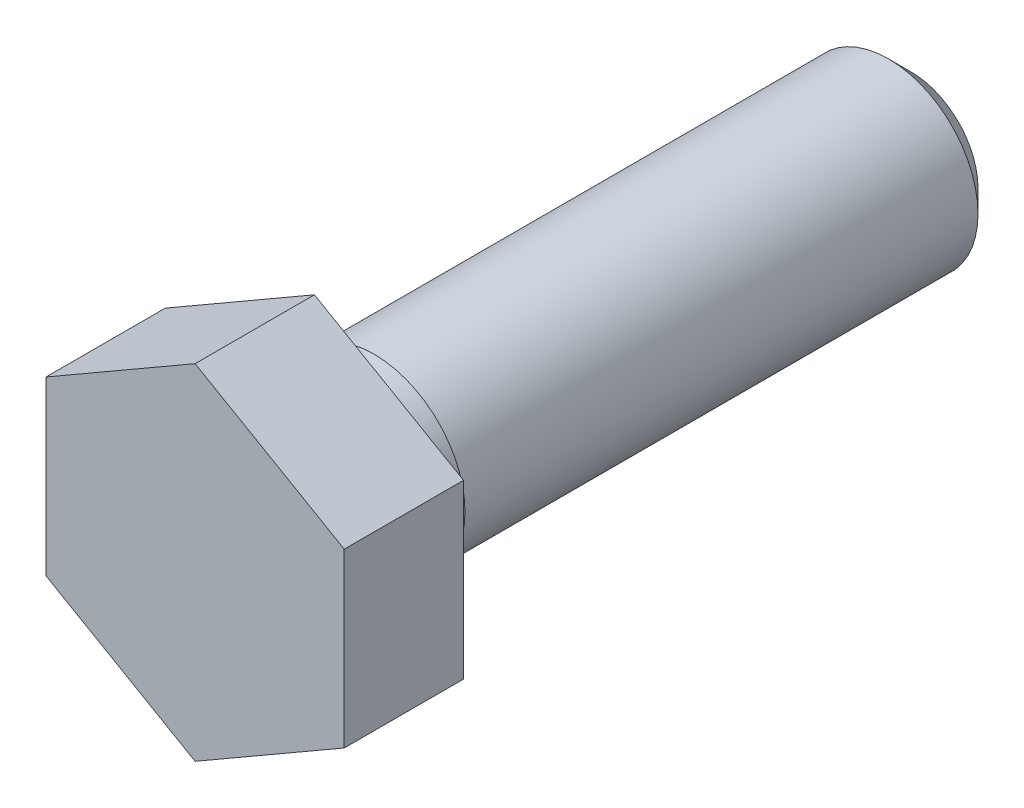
ISO-10303-21;
HEADER;
FILE_DESCRIPTION(('STEP AP214'),'2;1');
FILE_NAME('part.step','',(''),(''),'','','');
FILE_SCHEMA(('AUTOMOTIVE_DESIGN { 1 0 10303 214 1 1 1 1 }'));
ENDSEC;
DATA;
#1=APPLICATION_CONTEXT('core data for automotive mechanical design processes');
#2=APPLICATION_PROTOCOL_DEFINITION('international standard','automotive_design',2000,#1);
#3=PRODUCT_CONTEXT('',#1,'mechanical');
#4=PRODUCT('Part','Part','',(#3));
#5=PRODUCT_RELATED_PRODUCT_CATEGORY('part','',(#4));
#6=PRODUCT_DEFINITION_FORMATION('','',#4);
#7=PRODUCT_DEFINITION_CONTEXT('part definition',#1,'design');
#8=PRODUCT_DEFINITION('design','',#6,#7);
#9=PRODUCT_DEFINITION_SHAPE('','',#8);
#10=(LENGTH_UNIT() NAMED_UNIT(*) SI_UNIT(.MILLI.,.METRE.));
#11=(NAMED_UNIT(*) PLANE_ANGLE_UNIT() SI_UNIT($,.RADIAN.));
#12=(NAMED_UNIT(*) SI_UNIT($,.STERADIAN.) SOLID_ANGLE_UNIT());
#13=UNCERTAINTY_MEASURE_WITH_UNIT(LENGTH_MEASURE(1.E-05),#10,'distance_accuracy_value','');
#14=(GEOMETRIC_REPRESENTATION_CONTEXT(3) GLOBAL_UNCERTAINTY_ASSIGNED_CONTEXT((#13)) GLOBAL_UNIT_ASSIGNED_CONTEXT((#10,
#11,#12)) REPRESENTATION_CONTEXT('',''));
#15=CARTESIAN_POINT('',(0.,0.,0.));
#16=DIRECTION('',(0.,0.,1.));
#17=DIRECTION('',(1.,0.,0.));
#18=AXIS2_PLACEMENT_3D('',#15,#16,#17);
#19=CARTESIAN_POINT('',(0.,0.,-3.));
#20=DIRECTION('',(0.,0.,1.));
#21=DIRECTION('',(1.,0.,0.));
#22=AXIS2_PLACEMENT_3D('',#19,#20,#21);
#23=CYLINDRICAL_SURFACE('',#22,3.05);
#24=CARTESIAN_POINT('',(0.,0.,0.));
#25=DIRECTION('',(0.,0.,1.));
#26=DIRECTION('',(1.,0.,0.));
#27=AXIS2_PLACEMENT_3D('',#24,#25,#26);
#28=CIRCLE('',#27,3.05);
#29=CARTESIAN_POINT('',(3.05,0.,0.));
#30=VERTEX_POINT('',#29);
#31=EDGE_CURVE('E9',#30,#30,#28,.F.);
#32=ORIENTED_EDGE('',*,*,#31,.T.);
#33=EDGE_LOOP('',(#32));
#34=FACE_BOUND('',#33,.T.);
#35=CARTESIAN_POINT('',(0.,0.,-2.));
#36=DIRECTION('',(0.,0.,-1.));
#37=DIRECTION('',(0.,1.,0.));
#38=AXIS2_PLACEMENT_3D('',#35,#36,#37);
#39=CIRCLE('',#38,3.05);
#40=CARTESIAN_POINT('',(0.,3.05,-2.));
#41=VERTEX_POINT('',#40);
#42=EDGE_CURVE('E88',#41,#41,#39,.T.);
#43=ORIENTED_EDGE('',*,*,#42,.F.);
#44=EDGE_LOOP('',(#43));
#45=FACE_BOUND('',#44,.T.);
#46=ADVANCED_FACE('F14',(#34,#45),#23,.T.);
#47=CARTESIAN_POINT('',(0.,-5.77350269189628,0.));
#48=DIRECTION('',(0.,0.,1.));
#49=DIRECTION('',(1.,0.,0.));
#50=AXIS2_PLACEMENT_3D('',#47,#48,#49);
#51=PLANE('',#50);
#52=DIRECTION('',(-0.866025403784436,-0.5,0.));
#53=VECTOR('',#52,1.);
#54=CARTESIAN_POINT('',(5.,-2.8867513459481,0.));
#55=LINE('',#54,#53);
#56=CARTESIAN_POINT('',(5.,-2.8867513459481,0.));
#57=VERTEX_POINT('',#56);
#58=CARTESIAN_POINT('',(0.,-5.77350269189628,0.));
#59=VERTEX_POINT('',#58);
#60=EDGE_CURVE('E69',#57,#59,#55,.T.);
#61=ORIENTED_EDGE('',*,*,#60,.T.);
#62=DIRECTION('',(0.866025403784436,-0.5,0.));
#63=VECTOR('',#62,1.);
#64=CARTESIAN_POINT('',(-5.,-2.8867513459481,0.));
#65=LINE('',#64,#63);
#66=CARTESIAN_POINT('',(-5.,-2.8867513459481,0.));
#67=VERTEX_POINT('',#66);
#68=EDGE_CURVE('E84',#67,#59,#65,.T.);
#69=ORIENTED_EDGE('',*,*,#68,.F.);
#70=DIRECTION('',(0.,1.,0.));
#71=VECTOR('',#70,1.);
#72=CARTESIAN_POINT('',(-5.,-2.8867513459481,0.));
#73=LINE('',#72,#71);
#74=CARTESIAN_POINT('',(-5.,2.88675134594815,0.));
#75=VERTEX_POINT('',#74);
#76=EDGE_CURVE('E91',#67,#75,#73,.T.);
#77=ORIENTED_EDGE('',*,*,#76,.T.);
#78=DIRECTION('',(0.86602540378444,0.5,0.));
#79=VECTOR('',#78,1.);
#80=CARTESIAN_POINT('',(-5.,2.88675134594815,0.));
#81=LINE('',#80,#79);
#82=CARTESIAN_POINT('',(0.,5.77350269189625,0.));
#83=VERTEX_POINT('',#82);
#84=EDGE_CURVE('E93',#75,#83,#81,.T.);
#85=ORIENTED_EDGE('',*,*,#84,.T.);
#86=DIRECTION('',(-0.86602540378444,0.5,0.));
#87=VECTOR('',#86,1.);
#88=CARTESIAN_POINT('',(5.,2.88675134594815,0.));
#89=LINE('',#88,#87);
#90=CARTESIAN_POINT('',(5.,2.88675134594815,0.));
#91=VERTEX_POINT('',#90);
#92=EDGE_CURVE('E261',#91,#83,#89,.T.);
#93=ORIENTED_EDGE('',*,*,#92,.F.);
#94=DIRECTION('',(0.,1.,0.));
#95=VECTOR('',#94,1.);
#96=CARTESIAN_POINT('',(5.,-2.8867513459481,0.));
#97=LINE('',#96,#95);
#98=EDGE_CURVE('E87',#57,#91,#97,.T.);
#99=ORIENTED_EDGE('',*,*,#98,.F.);
#100=EDGE_LOOP('',(#61,#69,#77,#85,#93,#99));
#101=FACE_BOUND('',#100,.T.);
#102=ORIENTED_EDGE('',*,*,#31,.F.);
#103=EDGE_LOOP('',(#102));
#104=FACE_BOUND('',#103,.T.);
#105=ADVANCED_FACE('F81',(#101,#104),#51,.F.);
#106=CARTESIAN_POINT('',(5.,-2.8867513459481,4.));
#107=DIRECTION('',(0.5,-0.866025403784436,0.));
#108=DIRECTION('',(0.866025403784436,0.5,0.));
#109=AXIS2_PLACEMENT_3D('',#106,#107,#108);
#110=PLANE('',#109);
#111=DIRECTION('',(0.,0.,-1.));
#112=VECTOR('',#111,1.);
#113=CARTESIAN_POINT('',(5.,-2.8867513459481,4.));
#114=LINE('',#113,#112);
#115=CARTESIAN_POINT('',(5.,-2.8867513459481,4.));
#116=VERTEX_POINT('',#115);
#117=EDGE_CURVE('E29',#116,#57,#114,.T.);
#118=ORIENTED_EDGE('',*,*,#117,.F.);
#119=DIRECTION('',(-0.866025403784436,-0.5,0.));
#120=VECTOR('',#119,1.);
#121=CARTESIAN_POINT('',(5.,-2.8867513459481,4.));
#122=LINE('',#121,#120);
#123=CARTESIAN_POINT('',(0.,-5.77350269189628,4.));
#124=VERTEX_POINT('',#123);
#125=EDGE_CURVE('E71',#116,#124,#122,.T.);
#126=ORIENTED_EDGE('',*,*,#125,.T.);
#127=DIRECTION('',(0.,0.,-1.));
#128=VECTOR('',#127,1.);
#129=CARTESIAN_POINT('',(0.,-5.77350269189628,4.));
#130=LINE('',#129,#128);
#131=EDGE_CURVE('E66',#124,#59,#130,.T.);
#132=ORIENTED_EDGE('',*,*,#131,.T.);
#133=ORIENTED_EDGE('',*,*,#60,.F.);
#134=EDGE_LOOP('',(#118,#126,#132,#133));
#135=FACE_BOUND('',#134,.T.);
#136=ADVANCED_FACE('F68',(#135),#110,.T.);
#137=CARTESIAN_POINT('',(5.,-2.8867513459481,4.));
#138=DIRECTION('',(-1.,0.,0.));
#139=DIRECTION('',(0.,-1.,0.));
#140=AXIS2_PLACEMENT_3D('',#137,#138,#139);
#141=PLANE('',#140);
#142=DIRECTION('',(0.,0.,-1.));
#143=VECTOR('',#142,1.);
#144=CARTESIAN_POINT('',(5.,2.88675134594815,4.));
#145=LINE('',#144,#143);
#146=CARTESIAN_POINT('',(5.,2.88675134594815,4.));
#147=VERTEX_POINT('',#146);
#148=EDGE_CURVE('E37',#147,#91,#145,.T.);
#149=ORIENTED_EDGE('',*,*,#148,.F.);
#150=DIRECTION('',(0.,1.,0.));
#151=VECTOR('',#150,1.);
#152=CARTESIAN_POINT('',(5.,-2.8867513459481,4.));
#153=LINE('',#152,#151);
#154=EDGE_CURVE('E77',#116,#147,#153,.T.);
#155=ORIENTED_EDGE('',*,*,#154,.F.);
#156=ORIENTED_EDGE('',*,*,#117,.T.);
#157=ORIENTED_EDGE('',*,*,#98,.T.);
#158=EDGE_LOOP('',(#149,#155,#156,#157));
#159=FACE_BOUND('',#158,.T.);
#160=ADVANCED_FACE('F155',(#159),#141,.F.);
#161=CARTESIAN_POINT('',(5.,2.88675134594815,4.));
#162=DIRECTION('',(-0.5,-0.86602540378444,0.));
#163=DIRECTION('',(0.86602540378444,-0.5,0.));
#164=AXIS2_PLACEMENT_3D('',#161,#162,#163);
#165=PLANE('',#164);
#166=DIRECTION('',(0.,0.,-1.));
#167=VECTOR('',#166,1.);
#168=CARTESIAN_POINT('',(0.,5.77350269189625,4.));
#169=LINE('',#168,#167);
#170=CARTESIAN_POINT('',(0.,5.77350269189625,4.));
#171=VERTEX_POINT('',#170);
#172=EDGE_CURVE('E114',#171,#83,#169,.T.);
#173=ORIENTED_EDGE('',*,*,#172,.F.);
#174=DIRECTION('',(-0.86602540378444,0.5,0.));
#175=VECTOR('',#174,1.);
#176=CARTESIAN_POINT('',(5.,2.88675134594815,4.));
#177=LINE('',#176,#175);
#178=EDGE_CURVE('E99',#147,#171,#177,.T.);
#179=ORIENTED_EDGE('',*,*,#178,.F.);
#180=ORIENTED_EDGE('',*,*,#148,.T.);
#181=ORIENTED_EDGE('',*,*,#92,.T.);
#182=EDGE_LOOP('',(#173,#179,#180,#181));
#183=FACE_BOUND('',#182,.T.);
#184=ADVANCED_FACE('F164',(#183),#165,.F.);
#185=CARTESIAN_POINT('',(-5.,2.88675134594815,4.));
#186=DIRECTION('',(-0.5,0.86602540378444,0.));
#187=DIRECTION('',(-0.86602540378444,-0.5,0.));
#188=AXIS2_PLACEMENT_3D('',#185,#186,#187);
#189=PLANE('',#188);
#190=DIRECTION('',(0.,0.,-1.));
#191=VECTOR('',#190,1.);
#192=CARTESIAN_POINT('',(-5.,2.88675134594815,4.));
#193=LINE('',#192,#191);
#194=CARTESIAN_POINT('',(-5.,2.88675134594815,4.));
#195=VERTEX_POINT('',#194);
#196=EDGE_CURVE('E112',#195,#75,#193,.T.);
#197=ORIENTED_EDGE('',*,*,#196,.F.);
#198=DIRECTION('',(0.86602540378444,0.5,0.));
#199=VECTOR('',#198,1.);
#200=CARTESIAN_POINT('',(-5.,2.88675134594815,4.));
#201=LINE('',#200,#199);
#202=EDGE_CURVE('E102',#195,#171,#201,.T.);
#203=ORIENTED_EDGE('',*,*,#202,.T.);
#204=ORIENTED_EDGE('',*,*,#172,.T.);
#205=ORIENTED_EDGE('',*,*,#84,.F.);
#206=EDGE_LOOP('',(#197,#203,#204,#205));
#207=FACE_BOUND('',#206,.T.);
#208=ADVANCED_FACE('F160',(#207),#189,.T.);
#209=CARTESIAN_POINT('',(-5.,-2.8867513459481,4.));
#210=DIRECTION('',(-1.,0.,0.));
#211=DIRECTION('',(0.,0.,1.));
#212=AXIS2_PLACEMENT_3D('',#209,#210,#211);
#213=PLANE('',#212);
#214=DIRECTION('',(0.,0.,-1.));
#215=VECTOR('',#214,1.);
#216=CARTESIAN_POINT('',(-5.,-2.8867513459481,4.));
#217=LINE('',#216,#215);
#218=CARTESIAN_POINT('',(-5.,-2.8867513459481,4.));
#219=VERTEX_POINT('',#218);
#220=EDGE_CURVE('E76',#219,#67,#217,.T.);
#221=ORIENTED_EDGE('',*,*,#220,.F.);
#222=DIRECTION('',(0.,1.,0.));
#223=VECTOR('',#222,1.);
#224=CARTESIAN_POINT('',(-5.,-2.8867513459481,4.));
#225=LINE('',#224,#223);
#226=EDGE_CURVE('E105',#219,#195,#225,.T.);
#227=ORIENTED_EDGE('',*,*,#226,.T.);
#228=ORIENTED_EDGE('',*,*,#196,.T.);
#229=ORIENTED_EDGE('',*,*,#76,.F.);
#230=EDGE_LOOP('',(#221,#227,#228,#229));
#231=FACE_BOUND('',#230,.T.);
#232=ADVANCED_FACE('F152',(#231),#213,.T.);
#233=CARTESIAN_POINT('',(-5.,-2.8867513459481,4.));
#234=DIRECTION('',(0.5,0.866025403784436,0.));
#235=DIRECTION('',(-0.866025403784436,0.5,0.));
#236=AXIS2_PLACEMENT_3D('',#233,#234,#235);
#237=PLANE('',#236);
#238=DIRECTION('',(0.866025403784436,-0.5,0.));
#239=VECTOR('',#238,1.);
#240=CARTESIAN_POINT('',(-5.,-2.8867513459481,4.));
#241=LINE('',#240,#239);
#242=EDGE_CURVE('E108',#219,#124,#241,.T.);
#243=ORIENTED_EDGE('',*,*,#242,.F.);
#244=ORIENTED_EDGE('',*,*,#220,.T.);
#245=ORIENTED_EDGE('',*,*,#68,.T.);
#246=ORIENTED_EDGE('',*,*,#131,.F.);
#247=EDGE_LOOP('',(#243,#244,#245,#246));
#248=FACE_BOUND('',#247,.T.);
#249=ADVANCED_FACE('F90',(#248),#237,.F.);
#250=CARTESIAN_POINT('',(0.,-5.77350269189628,4.));
#251=DIRECTION('',(0.,0.,1.));
#252=DIRECTION('',(1.,0.,0.));
#253=AXIS2_PLACEMENT_3D('',#250,#251,#252);
#254=PLANE('',#253);
#255=ORIENTED_EDGE('',*,*,#125,.F.);
#256=ORIENTED_EDGE('',*,*,#154,.T.);
#257=ORIENTED_EDGE('',*,*,#178,.T.);
#258=ORIENTED_EDGE('',*,*,#202,.F.);
#259=ORIENTED_EDGE('',*,*,#226,.F.);
#260=ORIENTED_EDGE('',*,*,#242,.T.);
#261=EDGE_LOOP('',(#255,#256,#257,#258,#259,#260));
#262=FACE_BOUND('',#261,.T.);
#263=ADVANCED_FACE('F136',(#262),#254,.T.);
#264=CARTESIAN_POINT('',(0.,0.,-2.));
#265=DIRECTION('',(0.,0.,-1.));
#266=DIRECTION('',(0.,1.,0.));
#267=AXIS2_PLACEMENT_3D('',#264,#265,#266);
#268=PLANE('',#267);
#269=CARTESIAN_POINT('',(0.,0.,-2.));
#270=DIRECTION('',(0.,0.,-1.));
#271=DIRECTION('',(0.,1.,0.));
#272=AXIS2_PLACEMENT_3D('',#269,#270,#271);
#273=CIRCLE('',#272,3.);
#274=CARTESIAN_POINT('',(0.,3.,-2.));
#275=VERTEX_POINT('',#274);
#276=EDGE_CURVE('E255',#275,#275,#273,.T.);
#277=ORIENTED_EDGE('',*,*,#276,.F.);
#278=EDGE_LOOP('',(#277));
#279=FACE_BOUND('',#278,.T.);
#280=ORIENTED_EDGE('',*,*,#42,.T.);
#281=EDGE_LOOP('',(#280));
#282=FACE_BOUND('',#281,.T.);
#283=ADVANCED_FACE('F128',(#279,#282),#268,.T.);
#284=CARTESIAN_POINT('',(2.25,0.,-20.));
#285=DIRECTION('',(0.,0.,-1.));
#286=DIRECTION('',(-1.,0.,0.));
#287=AXIS2_PLACEMENT_3D('',#284,#285,#286);
#288=PLANE('',#287);
#289=CARTESIAN_POINT('',(0.,0.,-20.));
#290=DIRECTION('',(0.,0.,1.));
#291=DIRECTION('',(1.,0.,0.));
#292=AXIS2_PLACEMENT_3D('',#289,#290,#291);
#293=CIRCLE('',#292,2.25);
#294=CARTESIAN_POINT('',(2.25,0.,-20.));
#295=VERTEX_POINT('',#294);
#296=EDGE_CURVE('E22',#295,#295,#293,.T.);
#297=ORIENTED_EDGE('',*,*,#296,.F.);
#298=EDGE_LOOP('',(#297));
#299=FACE_BOUND('',#298,.T.);
#300=ADVANCED_FACE('F126',(#299),#288,.T.);
#301=CARTESIAN_POINT('',(0.,0.,-19.25));
#302=DIRECTION('',(0.,0.,1.));
#303=DIRECTION('',(1.,0.,0.));
#304=AXIS2_PLACEMENT_3D('',#301,#302,#303);
#305=CONICAL_SURFACE('',#304,3.,0.785398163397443);
#306=ORIENTED_EDGE('',*,*,#296,.T.);
#307=EDGE_LOOP('',(#306));
#308=FACE_BOUND('',#307,.T.);
#309=CARTESIAN_POINT('',(0.,0.,-19.25));
#310=DIRECTION('',(0.,0.,1.));
#311=DIRECTION('',(1.,0.,0.));
#312=AXIS2_PLACEMENT_3D('',#309,#310,#311);
#313=CIRCLE('',#312,3.);
#314=CARTESIAN_POINT('',(3.,0.,-19.25));
#315=VERTEX_POINT('',#314);
#316=EDGE_CURVE('E118',#315,#315,#313,.T.);
#317=ORIENTED_EDGE('',*,*,#316,.F.);
#318=EDGE_LOOP('',(#317));
#319=FACE_BOUND('',#318,.T.);
#320=ADVANCED_FACE('F123',(#308,#319),#305,.T.);
#321=CARTESIAN_POINT('',(0.,0.,10.));
#322=DIRECTION('',(0.,0.,1.));
#323=DIRECTION('',(1.,0.,0.));
#324=AXIS2_PLACEMENT_3D('',#321,#322,#323);
#325=CYLINDRICAL_SURFACE('',#324,3.);
#326=ORIENTED_EDGE('',*,*,#316,.T.);
#327=EDGE_LOOP('',(#326));
#328=FACE_BOUND('',#327,.T.);
#329=ORIENTED_EDGE('',*,*,#276,.T.);
#330=EDGE_LOOP('',(#329));
#331=FACE_BOUND('',#330,.T.);
#332=ADVANCED_FACE('F16',(#328,#331),#325,.T.);
#333=CLOSED_SHELL('',(#46,#105,#136,#160,#184,#208,#232,#249,#263,#283,#300,#320,#332));
#334=MANIFOLD_SOLID_BREP('B1',#333);
#335=ADVANCED_BREP_SHAPE_REPRESENTATION('',(#18,#334),#14);
#336=SHAPE_DEFINITION_REPRESENTATION(#9,#335);
ENDSEC;
END-ISO-10303-21;
